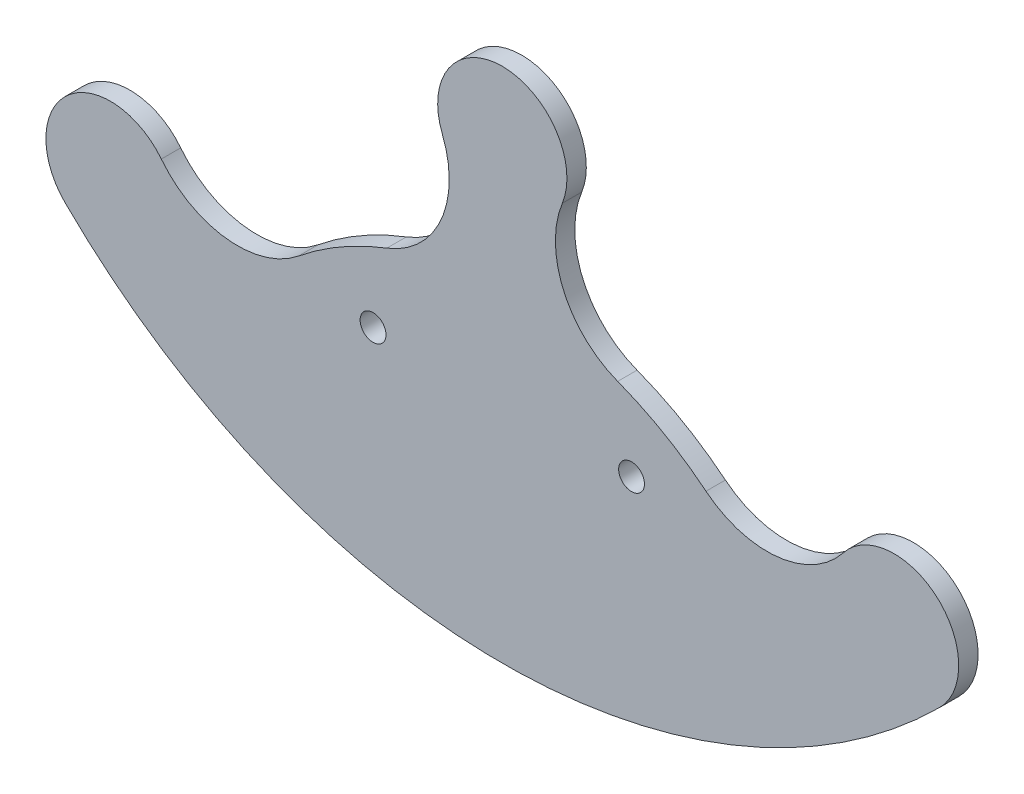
ISO-10303-21;
HEADER;
FILE_DESCRIPTION(('STEP AP214'),'2;1');
FILE_NAME('part.step','',(''),(''),'','','');
FILE_SCHEMA(('AUTOMOTIVE_DESIGN { 1 0 10303 214 1 1 1 1 }'));
ENDSEC;
DATA;
#1=APPLICATION_CONTEXT('core data for automotive mechanical design processes');
#2=APPLICATION_PROTOCOL_DEFINITION('international standard','automotive_design',2000,#1);
#3=PRODUCT_CONTEXT('',#1,'mechanical');
#4=PRODUCT('Part','Part','',(#3));
#5=PRODUCT_RELATED_PRODUCT_CATEGORY('part','',(#4));
#6=PRODUCT_DEFINITION_FORMATION('','',#4);
#7=PRODUCT_DEFINITION_CONTEXT('part definition',#1,'design');
#8=PRODUCT_DEFINITION('design','',#6,#7);
#9=PRODUCT_DEFINITION_SHAPE('','',#8);
#10=(LENGTH_UNIT() NAMED_UNIT(*) SI_UNIT(.MILLI.,.METRE.));
#11=(NAMED_UNIT(*) PLANE_ANGLE_UNIT() SI_UNIT($,.RADIAN.));
#12=(NAMED_UNIT(*) SI_UNIT($,.STERADIAN.) SOLID_ANGLE_UNIT());
#13=UNCERTAINTY_MEASURE_WITH_UNIT(LENGTH_MEASURE(1.E-05),#10,'distance_accuracy_value','');
#14=(GEOMETRIC_REPRESENTATION_CONTEXT(3) GLOBAL_UNCERTAINTY_ASSIGNED_CONTEXT((#13)) GLOBAL_UNIT_ASSIGNED_CONTEXT((#10,
#11,#12)) REPRESENTATION_CONTEXT('',''));
#15=CARTESIAN_POINT('',(0.,0.,0.));
#16=DIRECTION('',(0.,0.,1.));
#17=DIRECTION('',(1.,0.,0.));
#18=AXIS2_PLACEMENT_3D('',#15,#16,#17);
#19=CARTESIAN_POINT('',(-30.3108891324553,65.4999999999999,3.));
#20=DIRECTION('',(0.,0.,1.));
#21=DIRECTION('',(1.,0.,0.));
#22=AXIS2_PLACEMENT_3D('',#19,#20,#21);
#23=PLANE('',#22);
#24=CARTESIAN_POINT('',(-20.,35.,3.));
#25=DIRECTION('',(0.,0.,1.));
#26=DIRECTION('',(1.,0.,0.));
#27=AXIS2_PLACEMENT_3D('',#24,#25,#26);
#28=CIRCLE('',#27,2.);
#29=CARTESIAN_POINT('',(-18.,35.,3.));
#30=VERTEX_POINT('',#29);
#31=EDGE_CURVE('E143',#30,#30,#28,.T.);
#32=ORIENTED_EDGE('',*,*,#31,.F.);
#33=EDGE_LOOP('',(#32));
#34=FACE_BOUND('',#33,.T.);
#35=CARTESIAN_POINT('',(-60.6217782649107,35.,3.));
#36=DIRECTION('',(0.,0.,1.));
#37=DIRECTION('',(1.,0.,0.));
#38=AXIS2_PLACEMENT_3D('',#35,#36,#37);
#39=CIRCLE('',#38,9.99999999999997);
#40=CARTESIAN_POINT('',(-52.7628048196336,41.1835698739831,3.));
#41=VERTEX_POINT('',#40);
#42=CARTESIAN_POINT('',(-67.6708222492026,27.9069767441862,3.));
#43=VERTEX_POINT('',#42);
#44=EDGE_CURVE('E158',#41,#43,#39,.T.);
#45=ORIENTED_EDGE('',*,*,#44,.T.);
#46=CARTESIAN_POINT('',(0.,95.9999999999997,3.));
#47=DIRECTION('',(0.,0.,1.));
#48=DIRECTION('',(1.,0.,0.));
#49=AXIS2_PLACEMENT_3D('',#46,#47,#48);
#50=CIRCLE('',#49,95.9999999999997);
#51=CARTESIAN_POINT('',(67.6708222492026,27.9069767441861,3.));
#52=VERTEX_POINT('',#51);
#53=EDGE_CURVE('E96',#43,#52,#50,.T.);
#54=ORIENTED_EDGE('',*,*,#53,.T.);
#55=CARTESIAN_POINT('',(60.6217782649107,35.,3.));
#56=DIRECTION('',(0.,0.,1.));
#57=DIRECTION('',(-1.,0.,0.));
#58=AXIS2_PLACEMENT_3D('',#55,#56,#57);
#59=CIRCLE('',#58,9.99999999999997);
#60=CARTESIAN_POINT('',(52.7628048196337,41.183569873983,3.));
#61=VERTEX_POINT('',#60);
#62=EDGE_CURVE('E179',#52,#61,#59,.T.);
#63=ORIENTED_EDGE('',*,*,#62,.T.);
#64=CARTESIAN_POINT('',(40.9743446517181,50.4589246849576,3.));
#65=DIRECTION('',(0.,0.,-1.));
#66=DIRECTION('',(-1.,0.,0.));
#67=AXIS2_PLACEMENT_3D('',#64,#65,#66);
#68=CIRCLE('',#67,15.);
#69=CARTESIAN_POINT('',(31.5187266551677,38.8145574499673,3.));
#70=VERTEX_POINT('',#69);
#71=EDGE_CURVE('E198',#61,#70,#68,.T.);
#72=ORIENTED_EDGE('',*,*,#71,.T.);
#73=CARTESIAN_POINT('',(0.,0.,3.));
#74=DIRECTION('',(0.,0.,1.));
#75=DIRECTION('',(-1.,0.,0.));
#76=AXIS2_PLACEMENT_3D('',#73,#74,#75);
#77=CIRCLE('',#76,50.);
#78=CARTESIAN_POINT('',(17.8550294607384,46.7032967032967,3.));
#79=VERTEX_POINT('',#78);
#80=EDGE_CURVE('E195',#70,#79,#77,.T.);
#81=ORIENTED_EDGE('',*,*,#80,.T.);
#82=CARTESIAN_POINT('',(23.2115382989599,60.7142857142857,3.));
#83=DIRECTION('',(0.,0.,-1.));
#84=DIRECTION('',(-1.,0.,0.));
#85=AXIS2_PLACEMENT_3D('',#82,#83,#84);
#86=CIRCLE('',#85,15.);
#87=CARTESIAN_POINT('',(9.28461531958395,66.2857142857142,3.));
#88=VERTEX_POINT('',#87);
#89=EDGE_CURVE('E197',#79,#88,#86,.T.);
#90=ORIENTED_EDGE('',*,*,#89,.T.);
#91=CARTESIAN_POINT('',(0.,70.,3.));
#92=DIRECTION('',(0.,0.,1.));
#93=DIRECTION('',(1.,0.,0.));
#94=AXIS2_PLACEMENT_3D('',#91,#92,#93);
#95=CIRCLE('',#94,10.);
#96=CARTESIAN_POINT('',(-9.28461531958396,66.2857142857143,3.));
#97=VERTEX_POINT('',#96);
#98=EDGE_CURVE('E121',#88,#97,#95,.T.);
#99=ORIENTED_EDGE('',*,*,#98,.T.);
#100=CARTESIAN_POINT('',(-23.2115382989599,60.7142857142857,3.));
#101=DIRECTION('',(0.,0.,-1.));
#102=DIRECTION('',(1.,0.,0.));
#103=AXIS2_PLACEMENT_3D('',#100,#101,#102);
#104=CIRCLE('',#103,15.);
#105=CARTESIAN_POINT('',(-17.8550294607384,46.7032967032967,3.));
#106=VERTEX_POINT('',#105);
#107=EDGE_CURVE('E115',#97,#106,#104,.T.);
#108=ORIENTED_EDGE('',*,*,#107,.T.);
#109=CARTESIAN_POINT('',(0.,0.,3.));
#110=DIRECTION('',(0.,0.,1.));
#111=DIRECTION('',(1.,0.,0.));
#112=AXIS2_PLACEMENT_3D('',#109,#110,#111);
#113=CIRCLE('',#112,50.);
#114=CARTESIAN_POINT('',(-31.5187266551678,38.8145574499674,3.));
#115=VERTEX_POINT('',#114);
#116=EDGE_CURVE('E119',#106,#115,#113,.T.);
#117=ORIENTED_EDGE('',*,*,#116,.T.);
#118=CARTESIAN_POINT('',(-40.9743446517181,50.4589246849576,3.));
#119=DIRECTION('',(0.,0.,-1.));
#120=DIRECTION('',(1.,0.,0.));
#121=AXIS2_PLACEMENT_3D('',#118,#119,#120);
#122=CIRCLE('',#121,15.);
#123=EDGE_CURVE('E47',#115,#41,#122,.T.);
#124=ORIENTED_EDGE('',*,*,#123,.T.);
#125=EDGE_LOOP('',(#45,#54,#63,#72,#81,#90,#99,#108,#117,#124));
#126=FACE_BOUND('',#125,.T.);
#127=CARTESIAN_POINT('',(20.,35.,3.));
#128=DIRECTION('',(0.,0.,1.));
#129=DIRECTION('',(1.,0.,0.));
#130=AXIS2_PLACEMENT_3D('',#127,#128,#129);
#131=CIRCLE('',#130,2.00000000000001);
#132=CARTESIAN_POINT('',(22.,35.,3.));
#133=VERTEX_POINT('',#132);
#134=EDGE_CURVE('E209',#133,#133,#131,.T.);
#135=ORIENTED_EDGE('',*,*,#134,.F.);
#136=EDGE_LOOP('',(#135));
#137=FACE_BOUND('',#136,.T.);
#138=ADVANCED_FACE('F30',(#34,#126,#137),#23,.T.);
#139=CARTESIAN_POINT('',(-30.3108891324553,65.4999999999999,0.));
#140=DIRECTION('',(0.,0.,1.));
#141=DIRECTION('',(1.,0.,0.));
#142=AXIS2_PLACEMENT_3D('',#139,#140,#141);
#143=PLANE('',#142);
#144=CARTESIAN_POINT('',(-20.,35.,0.));
#145=DIRECTION('',(0.,0.,1.));
#146=DIRECTION('',(1.,0.,0.));
#147=AXIS2_PLACEMENT_3D('',#144,#145,#146);
#148=CIRCLE('',#147,2.);
#149=CARTESIAN_POINT('',(-18.,35.,0.));
#150=VERTEX_POINT('',#149);
#151=EDGE_CURVE('E206',#150,#150,#148,.T.);
#152=ORIENTED_EDGE('',*,*,#151,.T.);
#153=EDGE_LOOP('',(#152));
#154=FACE_BOUND('',#153,.T.);
#155=CARTESIAN_POINT('',(-60.6217782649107,35.,0.));
#156=DIRECTION('',(0.,0.,1.));
#157=DIRECTION('',(1.,0.,0.));
#158=AXIS2_PLACEMENT_3D('',#155,#156,#157);
#159=CIRCLE('',#158,9.99999999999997);
#160=CARTESIAN_POINT('',(-52.7628048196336,41.1835698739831,0.));
#161=VERTEX_POINT('',#160);
#162=CARTESIAN_POINT('',(-67.6708222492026,27.9069767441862,0.));
#163=VERTEX_POINT('',#162);
#164=EDGE_CURVE('E139',#161,#163,#159,.T.);
#165=ORIENTED_EDGE('',*,*,#164,.F.);
#166=CARTESIAN_POINT('',(-40.9743446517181,50.4589246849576,0.));
#167=DIRECTION('',(0.,0.,-1.));
#168=DIRECTION('',(1.,0.,0.));
#169=AXIS2_PLACEMENT_3D('',#166,#167,#168);
#170=CIRCLE('',#169,15.);
#171=CARTESIAN_POINT('',(-31.5187266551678,38.8145574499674,0.));
#172=VERTEX_POINT('',#171);
#173=EDGE_CURVE('E88',#172,#161,#170,.T.);
#174=ORIENTED_EDGE('',*,*,#173,.F.);
#175=CARTESIAN_POINT('',(0.,0.,0.));
#176=DIRECTION('',(0.,0.,1.));
#177=DIRECTION('',(1.,0.,0.));
#178=AXIS2_PLACEMENT_3D('',#175,#176,#177);
#179=CIRCLE('',#178,50.);
#180=CARTESIAN_POINT('',(-17.8550294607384,46.7032967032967,0.));
#181=VERTEX_POINT('',#180);
#182=EDGE_CURVE('E82',#181,#172,#179,.T.);
#183=ORIENTED_EDGE('',*,*,#182,.F.);
#184=CARTESIAN_POINT('',(-23.2115382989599,60.7142857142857,0.));
#185=DIRECTION('',(0.,0.,-1.));
#186=DIRECTION('',(1.,0.,0.));
#187=AXIS2_PLACEMENT_3D('',#184,#185,#186);
#188=CIRCLE('',#187,15.);
#189=CARTESIAN_POINT('',(-9.28461531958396,66.2857142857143,0.));
#190=VERTEX_POINT('',#189);
#191=EDGE_CURVE('E129',#190,#181,#188,.T.);
#192=ORIENTED_EDGE('',*,*,#191,.F.);
#193=CARTESIAN_POINT('',(0.,70.,0.));
#194=DIRECTION('',(0.,0.,1.));
#195=DIRECTION('',(1.,0.,0.));
#196=AXIS2_PLACEMENT_3D('',#193,#194,#195);
#197=CIRCLE('',#196,10.);
#198=CARTESIAN_POINT('',(9.28461531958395,66.2857142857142,0.));
#199=VERTEX_POINT('',#198);
#200=EDGE_CURVE('E153',#199,#190,#197,.T.);
#201=ORIENTED_EDGE('',*,*,#200,.F.);
#202=CARTESIAN_POINT('',(23.2115382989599,60.7142857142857,0.));
#203=DIRECTION('',(0.,0.,-1.));
#204=DIRECTION('',(-1.,0.,0.));
#205=AXIS2_PLACEMENT_3D('',#202,#203,#204);
#206=CIRCLE('',#205,15.);
#207=CARTESIAN_POINT('',(17.8550294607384,46.7032967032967,0.));
#208=VERTEX_POINT('',#207);
#209=EDGE_CURVE('E151',#208,#199,#206,.T.);
#210=ORIENTED_EDGE('',*,*,#209,.F.);
#211=CARTESIAN_POINT('',(0.,0.,0.));
#212=DIRECTION('',(0.,0.,1.));
#213=DIRECTION('',(-1.,0.,0.));
#214=AXIS2_PLACEMENT_3D('',#211,#212,#213);
#215=CIRCLE('',#214,50.);
#216=CARTESIAN_POINT('',(31.5187266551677,38.8145574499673,0.));
#217=VERTEX_POINT('',#216);
#218=EDGE_CURVE('E149',#217,#208,#215,.T.);
#219=ORIENTED_EDGE('',*,*,#218,.F.);
#220=CARTESIAN_POINT('',(40.9743446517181,50.4589246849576,0.));
#221=DIRECTION('',(0.,0.,-1.));
#222=DIRECTION('',(-1.,0.,0.));
#223=AXIS2_PLACEMENT_3D('',#220,#221,#222);
#224=CIRCLE('',#223,15.);
#225=CARTESIAN_POINT('',(52.7628048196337,41.183569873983,0.));
#226=VERTEX_POINT('',#225);
#227=EDGE_CURVE('E147',#226,#217,#224,.T.);
#228=ORIENTED_EDGE('',*,*,#227,.F.);
#229=CARTESIAN_POINT('',(60.6217782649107,35.,0.));
#230=DIRECTION('',(0.,0.,1.));
#231=DIRECTION('',(-1.,0.,0.));
#232=AXIS2_PLACEMENT_3D('',#229,#230,#231);
#233=CIRCLE('',#232,9.99999999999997);
#234=CARTESIAN_POINT('',(67.6708222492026,27.9069767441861,0.));
#235=VERTEX_POINT('',#234);
#236=EDGE_CURVE('E145',#235,#226,#233,.T.);
#237=ORIENTED_EDGE('',*,*,#236,.F.);
#238=CARTESIAN_POINT('',(0.,95.9999999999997,0.));
#239=DIRECTION('',(0.,0.,1.));
#240=DIRECTION('',(1.,0.,0.));
#241=AXIS2_PLACEMENT_3D('',#238,#239,#240);
#242=CIRCLE('',#241,95.9999999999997);
#243=EDGE_CURVE('E142',#163,#235,#242,.T.);
#244=ORIENTED_EDGE('',*,*,#243,.F.);
#245=EDGE_LOOP('',(#165,#174,#183,#192,#201,#210,#219,#228,#237,#244));
#246=FACE_BOUND('',#245,.T.);
#247=CARTESIAN_POINT('',(20.,35.,0.));
#248=DIRECTION('',(0.,0.,1.));
#249=DIRECTION('',(1.,0.,0.));
#250=AXIS2_PLACEMENT_3D('',#247,#248,#249);
#251=CIRCLE('',#250,2.00000000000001);
#252=CARTESIAN_POINT('',(22.,35.,0.));
#253=VERTEX_POINT('',#252);
#254=EDGE_CURVE('E212',#253,#253,#251,.T.);
#255=ORIENTED_EDGE('',*,*,#254,.T.);
#256=EDGE_LOOP('',(#255));
#257=FACE_BOUND('',#256,.T.);
#258=ADVANCED_FACE('F183',(#154,#246,#257),#143,.F.);
#259=CARTESIAN_POINT('',(-60.6217782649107,35.,3.));
#260=DIRECTION('',(0.,0.,-1.));
#261=DIRECTION('',(-1.,0.,0.));
#262=AXIS2_PLACEMENT_3D('',#259,#260,#261);
#263=CYLINDRICAL_SURFACE('',#262,9.99999999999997);
#264=ORIENTED_EDGE('',*,*,#164,.T.);
#265=DIRECTION('',(0.,0.,-1.));
#266=VECTOR('',#265,1.);
#267=CARTESIAN_POINT('',(-67.6708222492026,27.9069767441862,3.));
#268=LINE('',#267,#266);
#269=EDGE_CURVE('E11',#43,#163,#268,.T.);
#270=ORIENTED_EDGE('',*,*,#269,.F.);
#271=ORIENTED_EDGE('',*,*,#44,.F.);
#272=DIRECTION('',(0.,0.,-1.));
#273=VECTOR('',#272,1.);
#274=CARTESIAN_POINT('',(-52.7628048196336,41.1835698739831,3.));
#275=LINE('',#274,#273);
#276=EDGE_CURVE('E135',#41,#161,#275,.T.);
#277=ORIENTED_EDGE('',*,*,#276,.T.);
#278=EDGE_LOOP('',(#264,#270,#271,#277));
#279=FACE_BOUND('',#278,.T.);
#280=ADVANCED_FACE('F32',(#279),#263,.T.);
#281=CARTESIAN_POINT('',(0.,95.9999999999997,3.));
#282=DIRECTION('',(0.,0.,-1.));
#283=DIRECTION('',(-1.,0.,0.));
#284=AXIS2_PLACEMENT_3D('',#281,#282,#283);
#285=CYLINDRICAL_SURFACE('',#284,95.9999999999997);
#286=ORIENTED_EDGE('',*,*,#243,.T.);
#287=DIRECTION('',(0.,0.,-1.));
#288=VECTOR('',#287,1.);
#289=CARTESIAN_POINT('',(67.6708222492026,27.9069767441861,3.));
#290=LINE('',#289,#288);
#291=EDGE_CURVE('E39',#52,#235,#290,.T.);
#292=ORIENTED_EDGE('',*,*,#291,.F.);
#293=ORIENTED_EDGE('',*,*,#53,.F.);
#294=ORIENTED_EDGE('',*,*,#269,.T.);
#295=EDGE_LOOP('',(#286,#292,#293,#294));
#296=FACE_BOUND('',#295,.T.);
#297=ADVANCED_FACE('F253',(#296),#285,.T.);
#298=CARTESIAN_POINT('',(60.6217782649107,35.,3.));
#299=DIRECTION('',(0.,0.,-1.));
#300=DIRECTION('',(-1.,0.,0.));
#301=AXIS2_PLACEMENT_3D('',#298,#299,#300);
#302=CYLINDRICAL_SURFACE('',#301,9.99999999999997);
#303=ORIENTED_EDGE('',*,*,#236,.T.);
#304=DIRECTION('',(0.,0.,-1.));
#305=VECTOR('',#304,1.);
#306=CARTESIAN_POINT('',(52.7628048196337,41.183569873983,3.));
#307=LINE('',#306,#305);
#308=EDGE_CURVE('E171',#61,#226,#307,.T.);
#309=ORIENTED_EDGE('',*,*,#308,.F.);
#310=ORIENTED_EDGE('',*,*,#62,.F.);
#311=ORIENTED_EDGE('',*,*,#291,.T.);
#312=EDGE_LOOP('',(#303,#309,#310,#311));
#313=FACE_BOUND('',#312,.T.);
#314=ADVANCED_FACE('F177',(#313),#302,.T.);
#315=CARTESIAN_POINT('',(40.9743446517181,50.4589246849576,3.));
#316=DIRECTION('',(0.,0.,-1.));
#317=DIRECTION('',(-1.,0.,0.));
#318=AXIS2_PLACEMENT_3D('',#315,#316,#317);
#319=CYLINDRICAL_SURFACE('',#318,15.);
#320=ORIENTED_EDGE('',*,*,#227,.T.);
#321=DIRECTION('',(0.,0.,-1.));
#322=VECTOR('',#321,1.);
#323=CARTESIAN_POINT('',(31.5187266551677,38.8145574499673,3.));
#324=LINE('',#323,#322);
#325=EDGE_CURVE('E168',#70,#217,#324,.T.);
#326=ORIENTED_EDGE('',*,*,#325,.F.);
#327=ORIENTED_EDGE('',*,*,#71,.F.);
#328=ORIENTED_EDGE('',*,*,#308,.T.);
#329=EDGE_LOOP('',(#320,#326,#327,#328));
#330=FACE_BOUND('',#329,.T.);
#331=ADVANCED_FACE('F189',(#330),#319,.F.);
#332=CARTESIAN_POINT('',(0.,0.,3.));
#333=DIRECTION('',(0.,0.,-1.));
#334=DIRECTION('',(-1.,0.,0.));
#335=AXIS2_PLACEMENT_3D('',#332,#333,#334);
#336=CYLINDRICAL_SURFACE('',#335,50.);
#337=ORIENTED_EDGE('',*,*,#218,.T.);
#338=DIRECTION('',(0.,0.,-1.));
#339=VECTOR('',#338,1.);
#340=CARTESIAN_POINT('',(17.8550294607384,46.7032967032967,3.));
#341=LINE('',#340,#339);
#342=EDGE_CURVE('E165',#79,#208,#341,.T.);
#343=ORIENTED_EDGE('',*,*,#342,.F.);
#344=ORIENTED_EDGE('',*,*,#80,.F.);
#345=ORIENTED_EDGE('',*,*,#325,.T.);
#346=EDGE_LOOP('',(#337,#343,#344,#345));
#347=FACE_BOUND('',#346,.T.);
#348=ADVANCED_FACE('F193',(#347),#336,.T.);
#349=CARTESIAN_POINT('',(23.2115382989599,60.7142857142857,3.));
#350=DIRECTION('',(0.,0.,-1.));
#351=DIRECTION('',(-1.,0.,0.));
#352=AXIS2_PLACEMENT_3D('',#349,#350,#351);
#353=CYLINDRICAL_SURFACE('',#352,15.);
#354=ORIENTED_EDGE('',*,*,#209,.T.);
#355=DIRECTION('',(0.,0.,-1.));
#356=VECTOR('',#355,1.);
#357=CARTESIAN_POINT('',(9.28461531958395,66.2857142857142,3.));
#358=LINE('',#357,#356);
#359=EDGE_CURVE('E162',#88,#199,#358,.T.);
#360=ORIENTED_EDGE('',*,*,#359,.F.);
#361=ORIENTED_EDGE('',*,*,#89,.F.);
#362=ORIENTED_EDGE('',*,*,#342,.T.);
#363=EDGE_LOOP('',(#354,#360,#361,#362));
#364=FACE_BOUND('',#363,.T.);
#365=ADVANCED_FACE('F243',(#364),#353,.F.);
#366=CARTESIAN_POINT('',(0.,70.,3.));
#367=DIRECTION('',(0.,0.,-1.));
#368=DIRECTION('',(-1.,0.,0.));
#369=AXIS2_PLACEMENT_3D('',#366,#367,#368);
#370=CYLINDRICAL_SURFACE('',#369,10.);
#371=ORIENTED_EDGE('',*,*,#200,.T.);
#372=DIRECTION('',(0.,0.,-1.));
#373=VECTOR('',#372,1.);
#374=CARTESIAN_POINT('',(-9.28461531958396,66.2857142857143,3.));
#375=LINE('',#374,#373);
#376=EDGE_CURVE('E130',#97,#190,#375,.T.);
#377=ORIENTED_EDGE('',*,*,#376,.F.);
#378=ORIENTED_EDGE('',*,*,#98,.F.);
#379=ORIENTED_EDGE('',*,*,#359,.T.);
#380=EDGE_LOOP('',(#371,#377,#378,#379));
#381=FACE_BOUND('',#380,.T.);
#382=ADVANCED_FACE('F240',(#381),#370,.T.);
#383=CARTESIAN_POINT('',(-23.2115382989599,60.7142857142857,3.));
#384=DIRECTION('',(0.,0.,-1.));
#385=DIRECTION('',(-1.,0.,0.));
#386=AXIS2_PLACEMENT_3D('',#383,#384,#385);
#387=CYLINDRICAL_SURFACE('',#386,15.);
#388=ORIENTED_EDGE('',*,*,#191,.T.);
#389=DIRECTION('',(0.,0.,-1.));
#390=VECTOR('',#389,1.);
#391=CARTESIAN_POINT('',(-17.8550294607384,46.7032967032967,3.));
#392=LINE('',#391,#390);
#393=EDGE_CURVE('E126',#106,#181,#392,.T.);
#394=ORIENTED_EDGE('',*,*,#393,.F.);
#395=ORIENTED_EDGE('',*,*,#107,.F.);
#396=ORIENTED_EDGE('',*,*,#376,.T.);
#397=EDGE_LOOP('',(#388,#394,#395,#396));
#398=FACE_BOUND('',#397,.T.);
#399=ADVANCED_FACE('F127',(#398),#387,.F.);
#400=CARTESIAN_POINT('',(0.,0.,3.));
#401=DIRECTION('',(0.,0.,-1.));
#402=DIRECTION('',(-1.,0.,0.));
#403=AXIS2_PLACEMENT_3D('',#400,#401,#402);
#404=CYLINDRICAL_SURFACE('',#403,50.);
#405=ORIENTED_EDGE('',*,*,#182,.T.);
#406=DIRECTION('',(0.,0.,-1.));
#407=VECTOR('',#406,1.);
#408=CARTESIAN_POINT('',(-31.5187266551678,38.8145574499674,3.));
#409=LINE('',#408,#407);
#410=EDGE_CURVE('E131',#115,#172,#409,.T.);
#411=ORIENTED_EDGE('',*,*,#410,.F.);
#412=ORIENTED_EDGE('',*,*,#116,.F.);
#413=ORIENTED_EDGE('',*,*,#393,.T.);
#414=EDGE_LOOP('',(#405,#411,#412,#413));
#415=FACE_BOUND('',#414,.T.);
#416=ADVANCED_FACE('F133',(#415),#404,.T.);
#417=CARTESIAN_POINT('',(-40.9743446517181,50.4589246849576,3.));
#418=DIRECTION('',(0.,0.,-1.));
#419=DIRECTION('',(-1.,0.,0.));
#420=AXIS2_PLACEMENT_3D('',#417,#418,#419);
#421=CYLINDRICAL_SURFACE('',#420,15.);
#422=ORIENTED_EDGE('',*,*,#173,.T.);
#423=ORIENTED_EDGE('',*,*,#276,.F.);
#424=ORIENTED_EDGE('',*,*,#123,.F.);
#425=ORIENTED_EDGE('',*,*,#410,.T.);
#426=EDGE_LOOP('',(#422,#423,#424,#425));
#427=FACE_BOUND('',#426,.T.);
#428=ADVANCED_FACE('F233',(#427),#421,.F.);
#429=CARTESIAN_POINT('',(-20.,35.,3.));
#430=DIRECTION('',(0.,0.,-1.));
#431=DIRECTION('',(-1.,0.,0.));
#432=AXIS2_PLACEMENT_3D('',#429,#430,#431);
#433=CYLINDRICAL_SURFACE('',#432,2.);
#434=ORIENTED_EDGE('',*,*,#31,.T.);
#435=EDGE_LOOP('',(#434));
#436=FACE_BOUND('',#435,.T.);
#437=ORIENTED_EDGE('',*,*,#151,.F.);
#438=EDGE_LOOP('',(#437));
#439=FACE_BOUND('',#438,.T.);
#440=ADVANCED_FACE('F230',(#436,#439),#433,.F.);
#441=CARTESIAN_POINT('',(20.,35.,3.));
#442=DIRECTION('',(0.,0.,-1.));
#443=DIRECTION('',(-1.,0.,0.));
#444=AXIS2_PLACEMENT_3D('',#441,#442,#443);
#445=CYLINDRICAL_SURFACE('',#444,2.00000000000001);
#446=ORIENTED_EDGE('',*,*,#134,.T.);
#447=EDGE_LOOP('',(#446));
#448=FACE_BOUND('',#447,.T.);
#449=ORIENTED_EDGE('',*,*,#254,.F.);
#450=EDGE_LOOP('',(#449));
#451=FACE_BOUND('',#450,.T.);
#452=ADVANCED_FACE('F218',(#448,#451),#445,.F.);
#453=CLOSED_SHELL('',(#138,#258,#280,#297,#314,#331,#348,#365,#382,#399,#416,#428,#440,#452));
#454=MANIFOLD_SOLID_BREP('B2',#453);
#455=ADVANCED_BREP_SHAPE_REPRESENTATION('',(#18,#454),#14);
#456=SHAPE_DEFINITION_REPRESENTATION(#9,#455);
ENDSEC;
END-ISO-10303-21;
